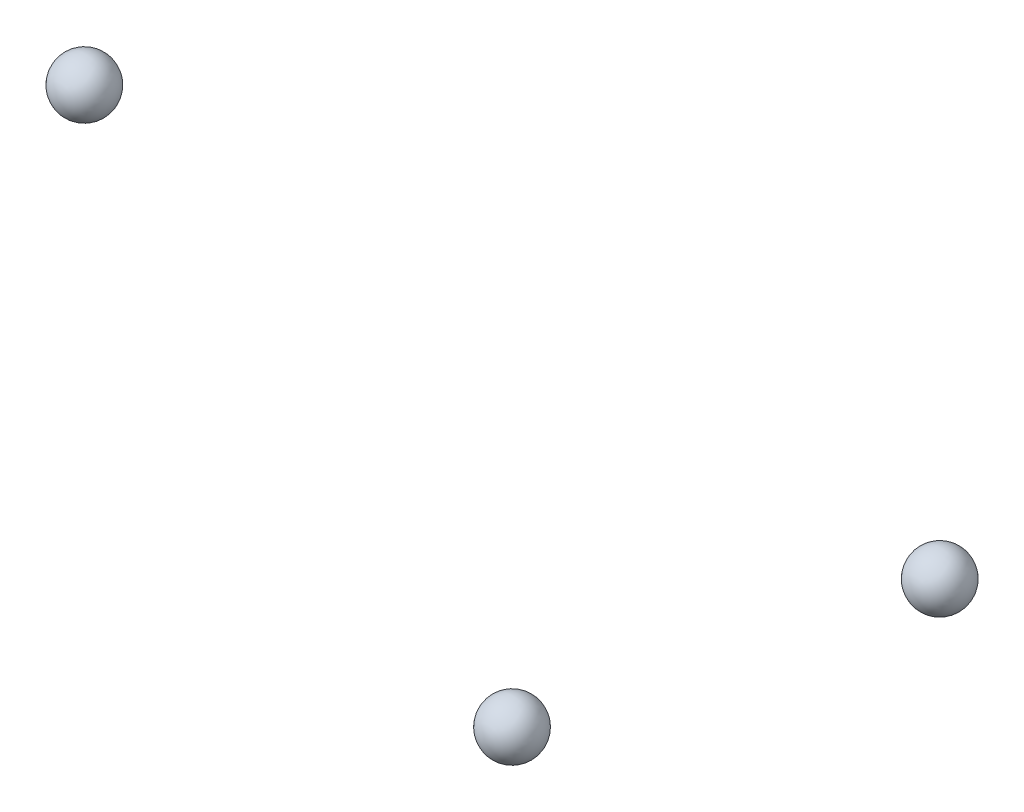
ISO-10303-21;
HEADER;
FILE_DESCRIPTION(('STEP AP214'),'2;1');
FILE_NAME('part.step','',(''),(''),'','','');
FILE_SCHEMA(('AUTOMOTIVE_DESIGN { 1 0 10303 214 1 1 1 1 }'));
ENDSEC;
DATA;
#1=APPLICATION_CONTEXT('core data for automotive mechanical design processes');
#2=APPLICATION_PROTOCOL_DEFINITION('international standard','automotive_design',2000,#1);
#3=PRODUCT_CONTEXT('',#1,'mechanical');
#4=PRODUCT('Part','Part','',(#3));
#5=PRODUCT_RELATED_PRODUCT_CATEGORY('part','',(#4));
#6=PRODUCT_DEFINITION_FORMATION('','',#4);
#7=PRODUCT_DEFINITION_CONTEXT('part definition',#1,'design');
#8=PRODUCT_DEFINITION('design','',#6,#7);
#9=PRODUCT_DEFINITION_SHAPE('','',#8);
#10=(LENGTH_UNIT() NAMED_UNIT(*) SI_UNIT(.MILLI.,.METRE.));
#11=(NAMED_UNIT(*) PLANE_ANGLE_UNIT() SI_UNIT($,.RADIAN.));
#12=(NAMED_UNIT(*) SI_UNIT($,.STERADIAN.) SOLID_ANGLE_UNIT());
#13=UNCERTAINTY_MEASURE_WITH_UNIT(LENGTH_MEASURE(1.E-05),#10,'distance_accuracy_value','');
#14=(GEOMETRIC_REPRESENTATION_CONTEXT(3) GLOBAL_UNCERTAINTY_ASSIGNED_CONTEXT((#13)) GLOBAL_UNIT_ASSIGNED_CONTEXT((#10,
#11,#12)) REPRESENTATION_CONTEXT('',''));
#15=CARTESIAN_POINT('',(0.,0.,0.));
#16=DIRECTION('',(0.,0.,1.));
#17=DIRECTION('',(1.,0.,0.));
#18=AXIS2_PLACEMENT_3D('',#15,#16,#17);
#19=CARTESIAN_POINT('',(50.,19.9999999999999,-21.0000000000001));
#20=DIRECTION('',(0.,0.,1.));
#21=DIRECTION('',(-1.,0.,0.));
#22=AXIS2_PLACEMENT_3D('',#19,#20,#21);
#23=SPHERICAL_SURFACE('',#22,3.175);
#24=CARTESIAN_POINT('',(50.,19.9999999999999,-17.8250000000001));
#25=VERTEX_POINT('',#24);
#26=VERTEX_LOOP('',#25);
#27=FACE_BOUND('',#26,.T.);
#28=ADVANCED_FACE('F37',(#27),#23,.T.);
#29=CLOSED_SHELL('',(#28));
#30=MANIFOLD_SOLID_BREP('B2',#29);
#31=CARTESIAN_POINT('',(0.,-20.,-21.));
#32=DIRECTION('',(0.,0.,1.));
#33=DIRECTION('',(-1.,0.,0.));
#34=AXIS2_PLACEMENT_3D('',#31,#32,#33);
#35=SPHERICAL_SURFACE('',#34,3.175);
#36=CARTESIAN_POINT('',(0.,-20.,-17.825));
#37=VERTEX_POINT('',#36);
#38=VERTEX_LOOP('',#37);
#39=FACE_BOUND('',#38,.T.);
#40=ADVANCED_FACE('F54',(#39),#35,.T.);
#41=CLOSED_SHELL('',(#40));
#42=MANIFOLD_SOLID_BREP('B6',#41);
#43=CARTESIAN_POINT('',(-50.,19.9999999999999,-21.0000000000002));
#44=DIRECTION('',(0.,0.,1.));
#45=DIRECTION('',(-1.,0.,0.));
#46=AXIS2_PLACEMENT_3D('',#43,#44,#45);
#47=SPHERICAL_SURFACE('',#46,3.175);
#48=CARTESIAN_POINT('',(-50.,19.9999999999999,-17.8250000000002));
#49=VERTEX_POINT('',#48);
#50=VERTEX_LOOP('',#49);
#51=FACE_BOUND('',#50,.T.);
#52=ADVANCED_FACE('F66',(#51),#47,.T.);
#53=CLOSED_SHELL('',(#52));
#54=MANIFOLD_SOLID_BREP('B33',#53);
#55=ADVANCED_BREP_SHAPE_REPRESENTATION('',(#18,#30,#42,#54),#14);
#56=SHAPE_DEFINITION_REPRESENTATION(#9,#55);
ENDSEC;
END-ISO-10303-21;
